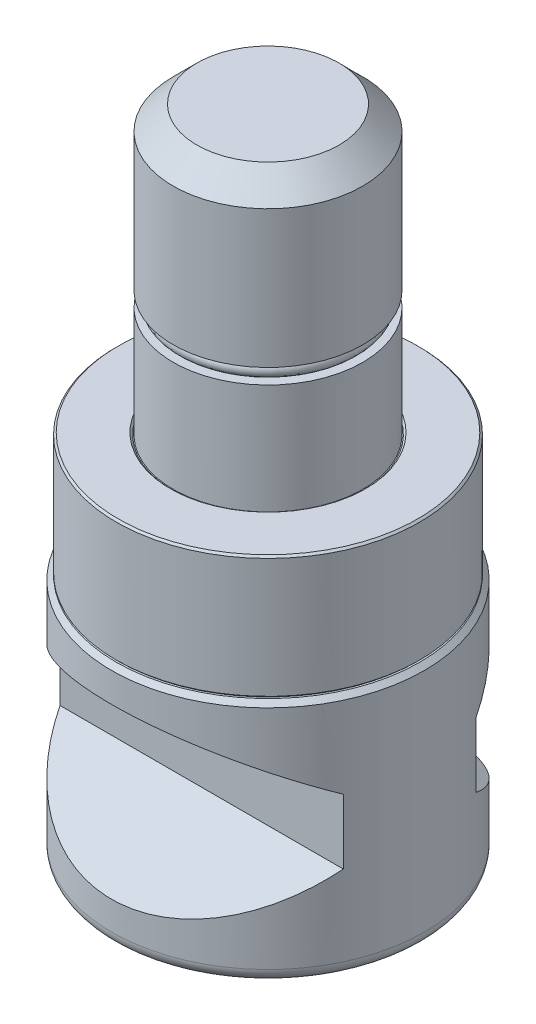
ISO-10303-21;
HEADER;
FILE_DESCRIPTION(('STEP AP214'),'2;1');
FILE_NAME('part.step','',(''),(''),'','','');
FILE_SCHEMA(('AUTOMOTIVE_DESIGN { 1 0 10303 214 1 1 1 1 }'));
ENDSEC;
DATA;
#1=APPLICATION_CONTEXT('core data for automotive mechanical design processes');
#2=APPLICATION_PROTOCOL_DEFINITION('international standard','automotive_design',2000,#1);
#3=PRODUCT_CONTEXT('',#1,'mechanical');
#4=PRODUCT('Part','Part','',(#3));
#5=PRODUCT_RELATED_PRODUCT_CATEGORY('part','',(#4));
#6=PRODUCT_DEFINITION_FORMATION('','',#4);
#7=PRODUCT_DEFINITION_CONTEXT('part definition',#1,'design');
#8=PRODUCT_DEFINITION('design','',#6,#7);
#9=PRODUCT_DEFINITION_SHAPE('','',#8);
#10=(LENGTH_UNIT() NAMED_UNIT(*) SI_UNIT(.MILLI.,.METRE.));
#11=(NAMED_UNIT(*) PLANE_ANGLE_UNIT() SI_UNIT($,.RADIAN.));
#12=(NAMED_UNIT(*) SI_UNIT($,.STERADIAN.) SOLID_ANGLE_UNIT());
#13=UNCERTAINTY_MEASURE_WITH_UNIT(LENGTH_MEASURE(1.E-05),#10,'distance_accuracy_value','');
#14=(GEOMETRIC_REPRESENTATION_CONTEXT(3) GLOBAL_UNCERTAINTY_ASSIGNED_CONTEXT((#13)) GLOBAL_UNIT_ASSIGNED_CONTEXT((#10,
#11,#12)) REPRESENTATION_CONTEXT('',''));
#15=CARTESIAN_POINT('',(0.,0.,0.));
#16=DIRECTION('',(0.,0.,1.));
#17=DIRECTION('',(1.,0.,0.));
#18=AXIS2_PLACEMENT_3D('',#15,#16,#17);
#19=CARTESIAN_POINT('',(0.,13.,0.));
#20=DIRECTION('',(0.,-1.,0.));
#21=DIRECTION('',(-0.99001051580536,0.,-0.140993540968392));
#22=AXIS2_PLACEMENT_3D('',#19,#20,#21);
#23=CYLINDRICAL_SURFACE('',#22,16.);
#24=CARTESIAN_POINT('',(0.,0.199999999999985,0.));
#25=DIRECTION('',(0.,-1.,0.));
#26=DIRECTION('',(-0.99001051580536,0.,-0.140993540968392));
#27=AXIS2_PLACEMENT_3D('',#24,#25,#26);
#28=CIRCLE('',#27,16.);
#29=CARTESIAN_POINT('',(-15.8401682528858,0.199999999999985,-2.25589665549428));
#30=VERTEX_POINT('',#29);
#31=EDGE_CURVE('E287',#30,#30,#28,.F.);
#32=ORIENTED_EDGE('',*,*,#31,.T.);
#33=EDGE_LOOP('',(#32));
#34=FACE_BOUND('',#33,.T.);
#35=CARTESIAN_POINT('',(0.,12.8,0.));
#36=DIRECTION('',(0.,1.,0.));
#37=DIRECTION('',(0.99001051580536,0.,0.140993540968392));
#38=AXIS2_PLACEMENT_3D('',#35,#36,#37);
#39=CIRCLE('',#38,16.);
#40=CARTESIAN_POINT('',(15.8401682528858,12.8,2.25589665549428));
#41=VERTEX_POINT('',#40);
#42=EDGE_CURVE('E546',#41,#41,#39,.F.);
#43=ORIENTED_EDGE('',*,*,#42,.T.);
#44=EDGE_LOOP('',(#43));
#45=FACE_BOUND('',#44,.T.);
#46=ADVANCED_FACE('F16',(#34,#45),#23,.T.);
#47=CARTESIAN_POINT('',(1.42403476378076,13.,-9.99910620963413));
#48=DIRECTION('',(0.,1.,0.));
#49=DIRECTION('',(0.99001051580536,0.,0.140993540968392));
#50=AXIS2_PLACEMENT_3D('',#47,#48,#49);
#51=PLANE('',#50);
#52=CARTESIAN_POINT('',(0.,13.,0.));
#53=DIRECTION('',(0.,1.,0.));
#54=DIRECTION('',(0.99001051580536,0.,0.140993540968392));
#55=AXIS2_PLACEMENT_3D('',#52,#53,#54);
#56=CIRCLE('',#55,15.8);
#57=CARTESIAN_POINT('',(15.6421661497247,13.,2.2276979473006));
#58=VERTEX_POINT('',#57);
#59=EDGE_CURVE('E549',#58,#58,#56,.T.);
#60=ORIENTED_EDGE('',*,*,#59,.T.);
#61=EDGE_LOOP('',(#60));
#62=FACE_BOUND('',#61,.T.);
#63=CARTESIAN_POINT('',(0.,13.,0.));
#64=DIRECTION('',(0.,1.,0.));
#65=DIRECTION('',(0.99001051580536,0.,0.140993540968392));
#66=AXIS2_PLACEMENT_3D('',#63,#64,#65);
#67=CIRCLE('',#66,10.3);
#68=CARTESIAN_POINT('',(10.1971083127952,13.,1.45223347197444));
#69=VERTEX_POINT('',#68);
#70=EDGE_CURVE('E541',#69,#69,#67,.F.);
#71=ORIENTED_EDGE('',*,*,#70,.T.);
#72=EDGE_LOOP('',(#71));
#73=FACE_BOUND('',#72,.T.);
#74=ADVANCED_FACE('F257',(#62,#73),#51,.T.);
#75=CARTESIAN_POINT('',(0.,13.,0.));
#76=DIRECTION('',(0.,1.,0.));
#77=DIRECTION('',(0.99001051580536,0.,0.140993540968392));
#78=AXIS2_PLACEMENT_3D('',#75,#76,#77);
#79=CONICAL_SURFACE('',#78,10.3,0.785398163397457);
#80=CARTESIAN_POINT('',(0.,12.8,0.));
#81=DIRECTION('',(0.,1.,0.));
#82=DIRECTION('',(0.99001051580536,0.,0.140993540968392));
#83=AXIS2_PLACEMENT_3D('',#80,#81,#82);
#84=CIRCLE('',#83,10.1);
#85=CARTESIAN_POINT('',(9.99910620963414,12.8,1.42403476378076));
#86=VERTEX_POINT('',#85);
#87=EDGE_CURVE('E544',#86,#86,#84,.T.);
#88=ORIENTED_EDGE('',*,*,#87,.F.);
#89=EDGE_LOOP('',(#88));
#90=FACE_BOUND('',#89,.T.);
#91=ORIENTED_EDGE('',*,*,#70,.F.);
#92=EDGE_LOOP('',(#91));
#93=FACE_BOUND('',#92,.T.);
#94=ADVANCED_FACE('F264',(#90,#93),#79,.F.);
#95=CARTESIAN_POINT('',(0.,12.8,0.));
#96=DIRECTION('',(0.,-1.,0.));
#97=DIRECTION('',(-0.99001051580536,0.,-0.140993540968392));
#98=AXIS2_PLACEMENT_3D('',#95,#96,#97);
#99=CONICAL_SURFACE('',#98,16.,0.785398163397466);
#100=ORIENTED_EDGE('',*,*,#59,.F.);
#101=EDGE_LOOP('',(#100));
#102=FACE_BOUND('',#101,.T.);
#103=ORIENTED_EDGE('',*,*,#42,.F.);
#104=EDGE_LOOP('',(#103));
#105=FACE_BOUND('',#104,.T.);
#106=ADVANCED_FACE('F273',(#102,#105),#99,.T.);
#107=CARTESIAN_POINT('',(0.,0.,0.));
#108=DIRECTION('',(0.,1.,0.));
#109=DIRECTION('',(0.99001051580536,0.,0.140993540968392));
#110=AXIS2_PLACEMENT_3D('',#107,#108,#109);
#111=CONICAL_SURFACE('',#110,15.8,0.785398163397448);
#112=ORIENTED_EDGE('',*,*,#31,.F.);
#113=EDGE_LOOP('',(#112));
#114=FACE_BOUND('',#113,.T.);
#115=CARTESIAN_POINT('',(0.,0.,0.));
#116=DIRECTION('',(0.,1.,0.));
#117=DIRECTION('',(0.,0.,1.));
#118=AXIS2_PLACEMENT_3D('',#115,#116,#117);
#119=CIRCLE('',#118,15.8);
#120=CARTESIAN_POINT('',(0.,0.,15.8));
#121=VERTEX_POINT('',#120);
#122=EDGE_CURVE('E10',#121,#121,#119,.T.);
#123=ORIENTED_EDGE('',*,*,#122,.T.);
#124=EDGE_LOOP('',(#123));
#125=FACE_BOUND('',#124,.T.);
#126=ADVANCED_FACE('F276',(#114,#125),#111,.T.);
#127=CARTESIAN_POINT('',(0.,-20.4,0.));
#128=DIRECTION('',(0.,-1.,0.));
#129=DIRECTION('',(-1.,0.,0.));
#130=AXIS2_PLACEMENT_3D('',#127,#128,#129);
#131=PLANE('',#130);
#132=DIRECTION('',(-0.866025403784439,0.,-0.5));
#133=VECTOR('',#132,1.);
#134=CARTESIAN_POINT('',(0.,-20.4,4.61880215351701));
#135=LINE('',#134,#133);
#136=CARTESIAN_POINT('',(0.,-20.4,4.61880215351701));
#137=VERTEX_POINT('',#136);
#138=CARTESIAN_POINT('',(-4.,-20.4,2.30940107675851));
#139=VERTEX_POINT('',#138);
#140=EDGE_CURVE('E122',#137,#139,#135,.T.);
#141=ORIENTED_EDGE('',*,*,#140,.T.);
#142=DIRECTION('',(0.,0.,-1.));
#143=VECTOR('',#142,1.);
#144=CARTESIAN_POINT('',(-4.,-20.4,2.30940107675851));
#145=LINE('',#144,#143);
#146=CARTESIAN_POINT('',(-4.,-20.4,-2.30940107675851));
#147=VERTEX_POINT('',#146);
#148=EDGE_CURVE('E118',#139,#147,#145,.T.);
#149=ORIENTED_EDGE('',*,*,#148,.T.);
#150=DIRECTION('',(0.866025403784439,0.,-0.5));
#151=VECTOR('',#150,1.);
#152=CARTESIAN_POINT('',(-4.,-20.4,-2.30940107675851));
#153=LINE('',#152,#151);
#154=CARTESIAN_POINT('',(0.,-20.4,-4.61880215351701));
#155=VERTEX_POINT('',#154);
#156=EDGE_CURVE('E111',#147,#155,#153,.T.);
#157=ORIENTED_EDGE('',*,*,#156,.T.);
#158=DIRECTION('',(0.866025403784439,0.,0.5));
#159=VECTOR('',#158,1.);
#160=CARTESIAN_POINT('',(0.,-20.4,-4.61880215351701));
#161=LINE('',#160,#159);
#162=CARTESIAN_POINT('',(4.,-20.4,-2.3094010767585));
#163=VERTEX_POINT('',#162);
#164=EDGE_CURVE('E115',#155,#163,#161,.T.);
#165=ORIENTED_EDGE('',*,*,#164,.T.);
#166=DIRECTION('',(0.,0.,1.));
#167=VECTOR('',#166,1.);
#168=CARTESIAN_POINT('',(4.,-20.4,-2.3094010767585));
#169=LINE('',#168,#167);
#170=CARTESIAN_POINT('',(4.,-20.4,2.30940107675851));
#171=VERTEX_POINT('',#170);
#172=EDGE_CURVE('E574',#163,#171,#169,.T.);
#173=ORIENTED_EDGE('',*,*,#172,.T.);
#174=DIRECTION('',(-0.866025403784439,0.,0.5));
#175=VECTOR('',#174,1.);
#176=CARTESIAN_POINT('',(4.,-20.4,2.30940107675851));
#177=LINE('',#176,#175);
#178=EDGE_CURVE('E572',#171,#137,#177,.T.);
#179=ORIENTED_EDGE('',*,*,#178,.T.);
#180=EDGE_LOOP('',(#141,#149,#157,#165,#173,#179));
#181=FACE_BOUND('',#180,.T.);
#182=ADVANCED_FACE('F198',(#181),#131,.T.);
#183=CARTESIAN_POINT('',(0.,-20.4,-4.61880215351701));
#184=DIRECTION('',(0.5,0.,-0.866025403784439));
#185=DIRECTION('',(-0.866025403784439,0.,-0.5));
#186=AXIS2_PLACEMENT_3D('',#183,#184,#185);
#187=PLANE('',#186);
#188=CARTESIAN_POINT('',(4.0002,-25.6799819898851,-2.30928560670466));
#189=CARTESIAN_POINT('',(3.82442084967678,-25.6213676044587,-2.4107717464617));
#190=CARTESIAN_POINT('',(3.64712438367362,-25.5680600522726,-2.51313390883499));
#191=CARTESIAN_POINT('',(3.2894614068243,-25.4750114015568,-2.71963072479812));
#192=CARTESIAN_POINT('',(3.10908854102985,-25.4353032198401,-2.82376904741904));
#193=CARTESIAN_POINT('',(2.75057818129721,-25.3734919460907,-3.03075510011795));
#194=CARTESIAN_POINT('',(2.57249584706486,-25.3509774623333,-3.13357098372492));
#195=CARTESIAN_POINT('',(2.21549328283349,-25.324100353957,-3.33968651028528));
#196=CARTESIAN_POINT('',(2.03657435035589,-25.3197154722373,-3.44298540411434));
#197=CARTESIAN_POINT('',(1.70225715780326,-25.3288398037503,-3.63600352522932));
#198=CARTESIAN_POINT('',(1.54680884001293,-25.3401086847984,-3.72575165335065));
#199=CARTESIAN_POINT('',(1.23692494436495,-25.3758237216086,-3.90466320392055));
#200=CARTESIAN_POINT('',(1.08249043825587,-25.4002820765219,-3.99382600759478));
#201=CARTESIAN_POINT('',(0.771967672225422,-25.4614257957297,-4.17310641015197));
#202=CARTESIAN_POINT('',(0.615918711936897,-25.4983703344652,-4.26320131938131));
#203=CARTESIAN_POINT('',(0.306148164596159,-25.5822198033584,-4.44204742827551));
#204=CARTESIAN_POINT('',(0.152422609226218,-25.6291050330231,-4.53080091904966));
#205=CARTESIAN_POINT('',(-0.000200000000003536,-25.6799819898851,-4.61891762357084));
#206=B_SPLINE_CURVE_WITH_KNOTS('',3,(#188,#189,#190,#191,#192,#193,#194,#195,#196,#197,#198,
#199,#200,#201,#202,#203,#204,#205),.UNSPECIFIED.,.F.,.F.,(4,2,2,2,2,2,2,2,4),(0.,
0.634047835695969,1.26961969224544,1.88946157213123,2.50854226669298,3.04757825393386,
3.58711366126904,4.13861653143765,4.68903648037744),.UNSPECIFIED.);
#207=CARTESIAN_POINT('',(4.,-25.6799153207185,-2.3094010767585));
#208=VERTEX_POINT('',#207);
#209=CARTESIAN_POINT('',(0.,-25.6799153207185,-4.61880215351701));
#210=VERTEX_POINT('',#209);
#211=EDGE_CURVE('E91',#208,#210,#206,.T.);
#212=ORIENTED_EDGE('',*,*,#211,.F.);
#213=DIRECTION('',(0.,-1.,0.));
#214=VECTOR('',#213,1.);
#215=CARTESIAN_POINT('',(4.,-20.4,-2.3094010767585));
#216=LINE('',#215,#214);
#217=EDGE_CURVE('E117',#163,#208,#216,.T.);
#218=ORIENTED_EDGE('',*,*,#217,.F.);
#219=ORIENTED_EDGE('',*,*,#164,.F.);
#220=DIRECTION('',(0.,-1.,0.));
#221=VECTOR('',#220,1.);
#222=CARTESIAN_POINT('',(0.,-20.4,-4.61880215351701));
#223=LINE('',#222,#221);
#224=EDGE_CURVE('E108',#155,#210,#223,.T.);
#225=ORIENTED_EDGE('',*,*,#224,.T.);
#226=EDGE_LOOP('',(#212,#218,#219,#225));
#227=FACE_BOUND('',#226,.T.);
#228=ADVANCED_FACE('F114',(#227),#187,.F.);
#229=CARTESIAN_POINT('',(4.,-20.4,-2.3094010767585));
#230=DIRECTION('',(1.,0.,0.));
#231=DIRECTION('',(0.,0.,-1.));
#232=AXIS2_PLACEMENT_3D('',#229,#230,#231);
#233=PLANE('',#232);
#234=CARTESIAN_POINT('',(4.,-28.051779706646,7.75631262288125));
#235=CARTESIAN_POINT('',(4.,-27.9588271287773,7.57514094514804));
#236=CARTESIAN_POINT('',(4.,-27.8663960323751,7.39369931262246));
#237=CARTESIAN_POINT('',(4.,-27.6828377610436,7.03015351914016));
#238=CARTESIAN_POINT('',(4.,-27.5917106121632,6.84804934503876));
#239=CARTESIAN_POINT('',(4.,-27.4108738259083,6.48275784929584));
#240=CARTESIAN_POINT('',(4.,-27.3211668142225,6.29956922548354));
#241=CARTESIAN_POINT('',(4.,-27.1436851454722,5.93225352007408));
#242=CARTESIAN_POINT('',(4.,-27.0559105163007,5.74812642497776));
#243=CARTESIAN_POINT('',(4.,-26.8782736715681,5.36918294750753));
#244=CARTESIAN_POINT('',(4.,-26.7885386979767,5.17430674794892));
#245=CARTESIAN_POINT('',(4.,-26.6124381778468,4.78304464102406));
#246=CARTESIAN_POINT('',(4.,-26.5260724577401,4.58665881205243));
#247=CARTESIAN_POINT('',(4.,-26.3577259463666,4.19216428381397));
#248=CARTESIAN_POINT('',(4.,-26.2757422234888,3.99405684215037));
#249=CARTESIAN_POINT('',(4.,-26.1173873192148,3.59554249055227));
#250=CARTESIAN_POINT('',(4.,-26.0410174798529,3.39513504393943));
#251=CARTESIAN_POINT('',(4.,-25.8833087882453,2.9573369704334));
#252=CARTESIAN_POINT('',(4.,-25.803331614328,2.71944997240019));
#253=CARTESIAN_POINT('',(4.,-25.6573348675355,2.23943941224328));
#254=CARTESIAN_POINT('',(4.,-25.5913080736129,1.99731811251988));
#255=CARTESIAN_POINT('',(4.,-25.5069180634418,1.6331545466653));
#256=CARTESIAN_POINT('',(4.,-25.4814067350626,1.51276218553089));
#257=CARTESIAN_POINT('',(4.,-25.4355332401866,1.27099219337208));
#258=CARTESIAN_POINT('',(4.,-25.4151709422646,1.14961458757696));
#259=CARTESIAN_POINT('',(4.,-25.3801799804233,0.906083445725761));
#260=CARTESIAN_POINT('',(4.,-25.3655487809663,0.783930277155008));
#261=CARTESIAN_POINT('',(4.,-25.342481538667,0.539041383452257));
#262=CARTESIAN_POINT('',(4.,-25.334045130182,0.416305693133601));
#263=CARTESIAN_POINT('',(4.,-25.3235999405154,0.169007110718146));
#264=CARTESIAN_POINT('',(4.,-25.3216735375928,0.0444406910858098));
#265=CARTESIAN_POINT('',(4.,-25.3245515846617,-0.204613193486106));
#266=CARTESIAN_POINT('',(4.,-25.3293560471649,-0.329100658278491));
#267=CARTESIAN_POINT('',(4.,-25.3455188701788,-0.577675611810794));
#268=CARTESIAN_POINT('',(4.,-25.3568787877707,-0.701762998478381));
#269=CARTESIAN_POINT('',(4.,-25.3857527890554,-0.949226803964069));
#270=CARTESIAN_POINT('',(4.,-25.4032678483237,-1.07260310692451));
#271=CARTESIAN_POINT('',(4.,-25.4650360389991,-1.44616252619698));
#272=CARTESIAN_POINT('',(4.,-25.5181610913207,-1.69489636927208));
#273=CARTESIAN_POINT('',(4.,-25.6423652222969,-2.18772666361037));
#274=CARTESIAN_POINT('',(4.,-25.7134490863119,-2.43182186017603));
#275=CARTESIAN_POINT('',(4.,-25.8639633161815,-2.90091972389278));
#276=CARTESIAN_POINT('',(4.,-25.9426157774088,-3.12617606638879));
#277=CARTESIAN_POINT('',(4.,-26.1084502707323,-3.57354672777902));
#278=CARTESIAN_POINT('',(4.,-26.1956341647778,-3.79566034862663));
#279=CARTESIAN_POINT('',(4.,-26.3763941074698,-4.23751628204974));
#280=CARTESIAN_POINT('',(4.,-26.4699765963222,-4.45725593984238));
#281=CARTESIAN_POINT('',(4.,-26.6618648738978,-4.89462873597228));
#282=CARTESIAN_POINT('',(4.,-26.7601702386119,-5.11226206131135));
#283=CARTESIAN_POINT('',(4.,-26.9548904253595,-5.53396134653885));
#284=CARTESIAN_POINT('',(4.,-27.0511129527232,-5.73811644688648));
#285=CARTESIAN_POINT('',(4.,-27.246089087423,-6.14521937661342));
#286=CARTESIAN_POINT('',(4.,-27.3448427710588,-6.34816716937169));
#287=CARTESIAN_POINT('',(4.,-27.5440508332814,-6.75245129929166));
#288=CARTESIAN_POINT('',(4.,-27.6444990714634,-6.95379066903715));
#289=CARTESIAN_POINT('',(4.,-27.847014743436,-7.35563323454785));
#290=CARTESIAN_POINT('',(4.,-27.9490820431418,-7.5561364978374));
#291=CARTESIAN_POINT('',(4.,-28.051779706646,-7.75631262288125));
#292=B_SPLINE_CURVE_WITH_KNOTS('',3,(#234,#235,#236,#237,#238,#239,#240,#241,#242,#243,#244,
#245,#246,#247,#248,#249,#250,#251,#252,#253,#254,#255,#256,#257,#258,#259,#260,#261,#262,#263,
#264,#265,#266,#267,#268,#269,#270,#271,#272,#273,#274,#275,#276,#277,#278,#279,#280,#281,#282,
#283,#284,#285,#286,#287,#288,#289,#290,#291),.UNSPECIFIED.,.F.,.F.,(4,2,2,2,2,2,2,2,2,2,2,2,2,
2,2,2,2,2,2,2,2,2,2,2,2,2,2,2,4),(0.,0.610878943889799,1.22177007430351,1.83368291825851,
2.44560458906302,3.08921144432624,3.73278510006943,4.37592266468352,5.0192134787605,
5.77184296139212,6.52408190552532,6.8931867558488,7.26228218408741,7.63121413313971,
8.00012430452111,8.37368556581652,8.74724752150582,9.12089824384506,9.49460821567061,
10.2566439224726,11.0188828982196,11.7344344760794,12.4501425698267,13.1665819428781,
13.8829571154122,14.5600200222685,15.2371033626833,15.9121114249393,16.5870638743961),.UNSPECIFIED.);
#293=CARTESIAN_POINT('',(4.,-25.6799153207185,2.30940107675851));
#294=VERTEX_POINT('',#293);
#295=EDGE_CURVE('E31',#294,#208,#292,.T.);
#296=ORIENTED_EDGE('',*,*,#295,.F.);
#297=DIRECTION('',(0.,-1.,0.));
#298=VECTOR('',#297,1.);
#299=CARTESIAN_POINT('',(4.,-20.4,2.30940107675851));
#300=LINE('',#299,#298);
#301=EDGE_CURVE('E120',#171,#294,#300,.T.);
#302=ORIENTED_EDGE('',*,*,#301,.F.);
#303=ORIENTED_EDGE('',*,*,#172,.F.);
#304=ORIENTED_EDGE('',*,*,#217,.T.);
#305=EDGE_LOOP('',(#296,#302,#303,#304));
#306=FACE_BOUND('',#305,.T.);
#307=ADVANCED_FACE('F246',(#306),#233,.F.);
#308=CARTESIAN_POINT('',(4.,-20.4,2.30940107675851));
#309=DIRECTION('',(0.5,0.,0.866025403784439));
#310=DIRECTION('',(0.866025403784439,0.,-0.5));
#311=AXIS2_PLACEMENT_3D('',#308,#309,#310);
#312=PLANE('',#311);
#313=CARTESIAN_POINT('',(-0.000199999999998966,-25.6799819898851,4.61891762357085));
#314=CARTESIAN_POINT('',(0.175579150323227,-25.6213676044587,4.51743148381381));
#315=CARTESIAN_POINT('',(0.352875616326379,-25.5680600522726,4.41506932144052));
#316=CARTESIAN_POINT('',(0.710538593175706,-25.4750114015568,4.2085725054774));
#317=CARTESIAN_POINT('',(0.890911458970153,-25.4353032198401,4.10443418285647));
#318=CARTESIAN_POINT('',(1.24942181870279,-25.3734919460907,3.89744813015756));
#319=CARTESIAN_POINT('',(1.42750415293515,-25.3509774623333,3.79463224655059));
#320=CARTESIAN_POINT('',(1.78450671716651,-25.324100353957,3.58851671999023));
#321=CARTESIAN_POINT('',(1.9634256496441,-25.3197154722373,3.48521782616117));
#322=CARTESIAN_POINT('',(2.29774284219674,-25.3288398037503,3.29219970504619));
#323=CARTESIAN_POINT('',(2.45319115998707,-25.3401086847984,3.20245157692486));
#324=CARTESIAN_POINT('',(2.76307505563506,-25.3758237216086,3.02354002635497));
#325=CARTESIAN_POINT('',(2.91750956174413,-25.4002820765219,2.93437722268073));
#326=CARTESIAN_POINT('',(3.22803232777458,-25.4614257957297,2.75509682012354));
#327=CARTESIAN_POINT('',(3.3840812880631,-25.4983703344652,2.6650019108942));
#328=CARTESIAN_POINT('',(3.69385183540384,-25.5822198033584,2.48615580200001));
#329=CARTESIAN_POINT('',(3.84757739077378,-25.6291050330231,2.39740231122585));
#330=CARTESIAN_POINT('',(4.0002,-25.6799819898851,2.30928560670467));
#331=B_SPLINE_CURVE_WITH_KNOTS('',3,(#313,#314,#315,#316,#317,#318,#319,#320,#321,#322,#323,
#324,#325,#326,#327,#328,#329,#330),.UNSPECIFIED.,.F.,.F.,(4,2,2,2,2,2,2,2,4),(0.,
0.634047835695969,1.26961969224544,1.88946157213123,2.50854226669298,3.04757825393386,
3.58711366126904,4.13861653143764,4.68903648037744),.UNSPECIFIED.);
#332=CARTESIAN_POINT('',(0.,-25.6799153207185,4.61880215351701));
#333=VERTEX_POINT('',#332);
#334=EDGE_CURVE('E212',#333,#294,#331,.T.);
#335=ORIENTED_EDGE('',*,*,#334,.F.);
#336=DIRECTION('',(0.,-1.,0.));
#337=VECTOR('',#336,1.);
#338=CARTESIAN_POINT('',(0.,-20.4,4.61880215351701));
#339=LINE('',#338,#337);
#340=EDGE_CURVE('E563',#137,#333,#339,.T.);
#341=ORIENTED_EDGE('',*,*,#340,.F.);
#342=ORIENTED_EDGE('',*,*,#178,.F.);
#343=ORIENTED_EDGE('',*,*,#301,.T.);
#344=EDGE_LOOP('',(#335,#341,#342,#343));
#345=FACE_BOUND('',#344,.T.);
#346=ADVANCED_FACE('F242',(#345),#312,.F.);
#347=CARTESIAN_POINT('',(0.,-20.4,4.61880215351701));
#348=DIRECTION('',(-0.5,0.,0.866025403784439));
#349=DIRECTION('',(0.866025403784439,0.,0.5));
#350=AXIS2_PLACEMENT_3D('',#347,#348,#349);
#351=PLANE('',#350);
#352=CARTESIAN_POINT('',(-4.0002,-25.6799819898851,2.30928560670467));
#353=CARTESIAN_POINT('',(-3.82442084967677,-25.6213676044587,2.41077174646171));
#354=CARTESIAN_POINT('',(-3.64712438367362,-25.5680600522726,2.513133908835));
#355=CARTESIAN_POINT('',(-3.28946140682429,-25.4750114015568,2.71963072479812));
#356=CARTESIAN_POINT('',(-3.10908854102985,-25.4353032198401,2.82376904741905));
#357=CARTESIAN_POINT('',(-2.75057818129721,-25.3734919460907,3.03075510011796));
#358=CARTESIAN_POINT('',(-2.57249584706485,-25.3509774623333,3.13357098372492));
#359=CARTESIAN_POINT('',(-2.21549328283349,-25.324100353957,3.33968651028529));
#360=CARTESIAN_POINT('',(-2.03657435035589,-25.3197154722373,3.44298540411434));
#361=CARTESIAN_POINT('',(-1.70225715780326,-25.3288398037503,3.63600352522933));
#362=CARTESIAN_POINT('',(-1.54680884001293,-25.3401086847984,3.72575165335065));
#363=CARTESIAN_POINT('',(-1.23692494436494,-25.3758237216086,3.90466320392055));
#364=CARTESIAN_POINT('',(-1.08249043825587,-25.4002820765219,3.99382600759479));
#365=CARTESIAN_POINT('',(-0.771967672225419,-25.4614257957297,4.17310641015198));
#366=CARTESIAN_POINT('',(-0.615918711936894,-25.4983703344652,4.26320131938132));
#367=CARTESIAN_POINT('',(-0.306148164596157,-25.5822198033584,4.44204742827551));
#368=CARTESIAN_POINT('',(-0.152422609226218,-25.6291050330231,4.53080091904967));
#369=CARTESIAN_POINT('',(0.000200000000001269,-25.6799819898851,4.61891762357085));
#370=B_SPLINE_CURVE_WITH_KNOTS('',3,(#352,#353,#354,#355,#356,#357,#358,#359,#360,#361,#362,
#363,#364,#365,#366,#367,#368,#369),.UNSPECIFIED.,.F.,.F.,(4,2,2,2,2,2,2,2,4),(0.,
0.634047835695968,1.26961969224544,1.88946157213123,2.50854226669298,3.04757825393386,
3.58711366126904,4.13861653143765,4.68903648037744),.UNSPECIFIED.);
#371=CARTESIAN_POINT('',(-4.,-25.6799153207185,2.30940107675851));
#372=VERTEX_POINT('',#371);
#373=EDGE_CURVE('E219',#372,#333,#370,.T.);
#374=ORIENTED_EDGE('',*,*,#373,.F.);
#375=DIRECTION('',(0.,-1.,0.));
#376=VECTOR('',#375,1.);
#377=CARTESIAN_POINT('',(-4.,-20.4,2.30940107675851));
#378=LINE('',#377,#376);
#379=EDGE_CURVE('E566',#139,#372,#378,.T.);
#380=ORIENTED_EDGE('',*,*,#379,.F.);
#381=ORIENTED_EDGE('',*,*,#140,.F.);
#382=ORIENTED_EDGE('',*,*,#340,.T.);
#383=EDGE_LOOP('',(#374,#380,#381,#382));
#384=FACE_BOUND('',#383,.T.);
#385=ADVANCED_FACE('F238',(#384),#351,.F.);
#386=CARTESIAN_POINT('',(-4.,-20.4,2.30940107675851));
#387=DIRECTION('',(-1.,0.,0.));
#388=DIRECTION('',(0.,0.,1.));
#389=AXIS2_PLACEMENT_3D('',#386,#387,#388);
#390=PLANE('',#389);
#391=CARTESIAN_POINT('',(-4.,-28.051779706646,-7.75631262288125));
#392=CARTESIAN_POINT('',(-4.,-27.9588271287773,-7.57514094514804));
#393=CARTESIAN_POINT('',(-4.,-27.8663960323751,-7.39369931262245));
#394=CARTESIAN_POINT('',(-4.,-27.6828377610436,-7.03015351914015));
#395=CARTESIAN_POINT('',(-4.,-27.5917106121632,-6.84804934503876));
#396=CARTESIAN_POINT('',(-4.,-27.4108738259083,-6.48275784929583));
#397=CARTESIAN_POINT('',(-4.,-27.3211668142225,-6.29956922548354));
#398=CARTESIAN_POINT('',(-4.,-27.1436851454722,-5.93225352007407));
#399=CARTESIAN_POINT('',(-4.,-27.0559105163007,-5.74812642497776));
#400=CARTESIAN_POINT('',(-4.,-26.8782736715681,-5.36918294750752));
#401=CARTESIAN_POINT('',(-4.,-26.7885386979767,-5.17430674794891));
#402=CARTESIAN_POINT('',(-4.,-26.6124381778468,-4.78304464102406));
#403=CARTESIAN_POINT('',(-4.,-26.5260724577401,-4.58665881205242));
#404=CARTESIAN_POINT('',(-4.,-26.3577259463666,-4.19216428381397));
#405=CARTESIAN_POINT('',(-4.,-26.2757422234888,-3.99405684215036));
#406=CARTESIAN_POINT('',(-4.,-26.1173873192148,-3.59554249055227));
#407=CARTESIAN_POINT('',(-4.,-26.0410174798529,-3.39513504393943));
#408=CARTESIAN_POINT('',(-4.,-25.8833087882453,-2.9573369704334));
#409=CARTESIAN_POINT('',(-4.,-25.803331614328,-2.71944997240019));
#410=CARTESIAN_POINT('',(-4.,-25.6573348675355,-2.23943941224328));
#411=CARTESIAN_POINT('',(-4.,-25.5913080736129,-1.99731811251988));
#412=CARTESIAN_POINT('',(-4.,-25.5069180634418,-1.6331545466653));
#413=CARTESIAN_POINT('',(-4.,-25.4814067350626,-1.51276218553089));
#414=CARTESIAN_POINT('',(-4.,-25.4355332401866,-1.27099219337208));
#415=CARTESIAN_POINT('',(-4.,-25.4151709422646,-1.14961458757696));
#416=CARTESIAN_POINT('',(-4.,-25.3801799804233,-0.906083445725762));
#417=CARTESIAN_POINT('',(-4.,-25.3655487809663,-0.78393027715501));
#418=CARTESIAN_POINT('',(-4.,-25.342481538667,-0.539041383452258));
#419=CARTESIAN_POINT('',(-4.,-25.334045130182,-0.416305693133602));
#420=CARTESIAN_POINT('',(-4.,-25.3235999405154,-0.169007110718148));
#421=CARTESIAN_POINT('',(-4.,-25.3216735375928,-0.0444406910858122));
#422=CARTESIAN_POINT('',(-4.,-25.3245515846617,0.204613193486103));
#423=CARTESIAN_POINT('',(-4.,-25.3293560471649,0.329100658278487));
#424=CARTESIAN_POINT('',(-4.,-25.3455188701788,0.57767561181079));
#425=CARTESIAN_POINT('',(-4.,-25.3568787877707,0.701762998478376));
#426=CARTESIAN_POINT('',(-4.,-25.3857527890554,0.949226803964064));
#427=CARTESIAN_POINT('',(-4.,-25.4032678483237,1.07260310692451));
#428=CARTESIAN_POINT('',(-4.,-25.4650360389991,1.44616252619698));
#429=CARTESIAN_POINT('',(-4.,-25.5181610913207,1.69489636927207));
#430=CARTESIAN_POINT('',(-4.,-25.6423652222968,2.18772666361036));
#431=CARTESIAN_POINT('',(-4.,-25.7134490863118,2.43182186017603));
#432=CARTESIAN_POINT('',(-4.,-25.8639633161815,2.90091972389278));
#433=CARTESIAN_POINT('',(-4.,-25.9426157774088,3.12617606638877));
#434=CARTESIAN_POINT('',(-4.,-26.1084502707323,3.573546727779));
#435=CARTESIAN_POINT('',(-4.,-26.1956341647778,3.79566034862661));
#436=CARTESIAN_POINT('',(-4.,-26.3763941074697,4.23751628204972));
#437=CARTESIAN_POINT('',(-4.,-26.4699765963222,4.45725593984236));
#438=CARTESIAN_POINT('',(-4.,-26.6618648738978,4.89462873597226));
#439=CARTESIAN_POINT('',(-4.,-26.7601702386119,5.11226206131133));
#440=CARTESIAN_POINT('',(-4.,-26.9548904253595,5.53396134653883));
#441=CARTESIAN_POINT('',(-4.,-27.0511129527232,5.73811644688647));
#442=CARTESIAN_POINT('',(-4.,-27.246089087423,6.14521937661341));
#443=CARTESIAN_POINT('',(-4.,-27.3448427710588,6.34816716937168));
#444=CARTESIAN_POINT('',(-4.,-27.5440508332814,6.75245129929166));
#445=CARTESIAN_POINT('',(-4.,-27.6444990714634,6.95379066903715));
#446=CARTESIAN_POINT('',(-4.,-27.847014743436,7.35563323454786));
#447=CARTESIAN_POINT('',(-4.,-27.9490820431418,7.5561364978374));
#448=CARTESIAN_POINT('',(-4.,-28.051779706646,7.75631262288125));
#449=B_SPLINE_CURVE_WITH_KNOTS('',3,(#391,#392,#393,#394,#395,#396,#397,#398,#399,#400,#401,
#402,#403,#404,#405,#406,#407,#408,#409,#410,#411,#412,#413,#414,#415,#416,#417,#418,#419,#420,
#421,#422,#423,#424,#425,#426,#427,#428,#429,#430,#431,#432,#433,#434,#435,#436,#437,#438,#439,
#440,#441,#442,#443,#444,#445,#446,#447,#448),.UNSPECIFIED.,.F.,.F.,(4,2,2,2,2,2,2,2,2,2,2,2,2,
2,2,2,2,2,2,2,2,2,2,2,2,2,2,2,4),(0.,0.610878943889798,1.22177007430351,1.83368291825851,
2.44560458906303,3.08921144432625,3.73278510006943,4.37592266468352,5.0192134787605,
5.77184296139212,6.52408190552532,6.8931867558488,7.26228218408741,7.63121413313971,
8.00012430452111,8.37368556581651,8.74724752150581,9.12089824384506,9.4946082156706,
10.2566439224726,11.0188828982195,11.7344344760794,12.4501425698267,13.166581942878,
13.8829571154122,14.5600200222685,15.2371033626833,15.9121114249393,16.5870638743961),.UNSPECIFIED.);
#450=CARTESIAN_POINT('',(-4.,-25.6799153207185,-2.30940107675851));
#451=VERTEX_POINT('',#450);
#452=EDGE_CURVE('E112',#451,#372,#449,.T.);
#453=ORIENTED_EDGE('',*,*,#452,.F.);
#454=DIRECTION('',(0.,-1.,0.));
#455=VECTOR('',#454,1.);
#456=CARTESIAN_POINT('',(-4.,-20.4,-2.30940107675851));
#457=LINE('',#456,#455);
#458=EDGE_CURVE('E110',#147,#451,#457,.T.);
#459=ORIENTED_EDGE('',*,*,#458,.F.);
#460=ORIENTED_EDGE('',*,*,#148,.F.);
#461=ORIENTED_EDGE('',*,*,#379,.T.);
#462=EDGE_LOOP('',(#453,#459,#460,#461));
#463=FACE_BOUND('',#462,.T.);
#464=ADVANCED_FACE('F235',(#463),#390,.F.);
#465=CARTESIAN_POINT('',(-4.,-20.4,-2.30940107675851));
#466=DIRECTION('',(-0.5,0.,-0.866025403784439));
#467=DIRECTION('',(-0.866025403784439,0.,0.5));
#468=AXIS2_PLACEMENT_3D('',#465,#466,#467);
#469=PLANE('',#468);
#470=CARTESIAN_POINT('',(0.000199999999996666,-25.6799819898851,-4.61891762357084));
#471=CARTESIAN_POINT('',(-0.175579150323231,-25.6213676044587,-4.5174314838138));
#472=CARTESIAN_POINT('',(-0.352875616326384,-25.5680600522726,-4.41506932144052));
#473=CARTESIAN_POINT('',(-0.710538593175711,-25.4750114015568,-4.20857250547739));
#474=CARTESIAN_POINT('',(-0.890911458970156,-25.4353032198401,-4.10443418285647));
#475=CARTESIAN_POINT('',(-1.2494218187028,-25.3734919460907,-3.89744813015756));
#476=CARTESIAN_POINT('',(-1.42750415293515,-25.3509774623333,-3.79463224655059));
#477=CARTESIAN_POINT('',(-1.78450671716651,-25.324100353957,-3.58851671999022));
#478=CARTESIAN_POINT('',(-1.96342564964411,-25.3197154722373,-3.48521782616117));
#479=CARTESIAN_POINT('',(-2.29774284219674,-25.3288398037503,-3.29219970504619));
#480=CARTESIAN_POINT('',(-2.45319115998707,-25.3401086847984,-3.20245157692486));
#481=CARTESIAN_POINT('',(-2.76307505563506,-25.3758237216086,-3.02354002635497));
#482=CARTESIAN_POINT('',(-2.91750956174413,-25.4002820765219,-2.93437722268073));
#483=CARTESIAN_POINT('',(-3.22803232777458,-25.4614257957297,-2.75509682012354));
#484=CARTESIAN_POINT('',(-3.38408128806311,-25.4983703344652,-2.6650019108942));
#485=CARTESIAN_POINT('',(-3.69385183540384,-25.5822198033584,-2.48615580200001));
#486=CARTESIAN_POINT('',(-3.84757739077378,-25.6291050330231,-2.39740231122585));
#487=CARTESIAN_POINT('',(-4.0002,-25.6799819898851,-2.30928560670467));
#488=B_SPLINE_CURVE_WITH_KNOTS('',3,(#470,#471,#472,#473,#474,#475,#476,#477,#478,#479,#480,
#481,#482,#483,#484,#485,#486,#487),.UNSPECIFIED.,.F.,.F.,(4,2,2,2,2,2,2,2,4),(0.,
0.634047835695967,1.26961969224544,1.88946157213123,2.50854226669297,3.04757825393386,
3.58711366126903,4.13861653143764,4.68903648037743),.UNSPECIFIED.);
#489=EDGE_CURVE('E94',#210,#451,#488,.T.);
#490=ORIENTED_EDGE('',*,*,#489,.F.);
#491=ORIENTED_EDGE('',*,*,#224,.F.);
#492=ORIENTED_EDGE('',*,*,#156,.F.);
#493=ORIENTED_EDGE('',*,*,#458,.T.);
#494=EDGE_LOOP('',(#490,#491,#492,#493));
#495=FACE_BOUND('',#494,.T.);
#496=ADVANCED_FACE('F106',(#495),#469,.F.);
#497=CARTESIAN_POINT('',(0.,-25.9,0.));
#498=DIRECTION('',(0.,-1.,0.));
#499=DIRECTION('',(-1.,0.,0.));
#500=AXIS2_PLACEMENT_3D('',#497,#498,#499);
#501=CONICAL_SURFACE('',#500,5.,1.0471975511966);
#502=CARTESIAN_POINT('',(0.,-25.9,0.));
#503=DIRECTION('',(0.,1.,0.));
#504=DIRECTION('',(1.,0.,0.));
#505=AXIS2_PLACEMENT_3D('',#502,#503,#504);
#506=CIRCLE('',#505,5.);
#507=CARTESIAN_POINT('',(5.,-25.9,0.));
#508=VERTEX_POINT('',#507);
#509=EDGE_CURVE('E552',#508,#508,#506,.T.);
#510=ORIENTED_EDGE('',*,*,#509,.F.);
#511=EDGE_LOOP('',(#510));
#512=FACE_BOUND('',#511,.T.);
#513=ORIENTED_EDGE('',*,*,#489,.T.);
#514=ORIENTED_EDGE('',*,*,#452,.T.);
#515=ORIENTED_EDGE('',*,*,#373,.T.);
#516=ORIENTED_EDGE('',*,*,#334,.T.);
#517=ORIENTED_EDGE('',*,*,#295,.T.);
#518=ORIENTED_EDGE('',*,*,#211,.T.);
#519=EDGE_LOOP('',(#513,#514,#515,#516,#517,#518));
#520=FACE_BOUND('',#519,.T.);
#521=ADVANCED_FACE('F93',(#512,#520),#501,.F.);
#522=CARTESIAN_POINT('',(0.,-25.9,-16.5));
#523=DIRECTION('',(0.,-1.,0.));
#524=DIRECTION('',(-1.,0.,0.));
#525=AXIS2_PLACEMENT_3D('',#522,#523,#524);
#526=PLANE('',#525);
#527=ORIENTED_EDGE('',*,*,#509,.T.);
#528=EDGE_LOOP('',(#527));
#529=FACE_BOUND('',#528,.T.);
#530=CARTESIAN_POINT('',(0.,-25.9,0.));
#531=DIRECTION('',(0.,-1.,0.));
#532=DIRECTION('',(-1.,0.,0.));
#533=AXIS2_PLACEMENT_3D('',#530,#531,#532);
#534=CIRCLE('',#533,15.);
#535=CARTESIAN_POINT('',(-15.,-25.9,0.));
#536=VERTEX_POINT('',#535);
#537=EDGE_CURVE('E176',#536,#536,#534,.T.);
#538=ORIENTED_EDGE('',*,*,#537,.T.);
#539=EDGE_LOOP('',(#538));
#540=FACE_BOUND('',#539,.T.);
#541=ADVANCED_FACE('F194',(#529,#540),#526,.T.);
#542=CARTESIAN_POINT('',(-20.,-3.6,16.5));
#543=DIRECTION('',(0.,-0.866025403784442,0.5));
#544=DIRECTION('',(0.,-0.5,-0.866025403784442));
#545=AXIS2_PLACEMENT_3D('',#542,#543,#544);
#546=PLANE('',#545);
#547=DIRECTION('',(1.,0.,0.));
#548=VECTOR('',#547,1.);
#549=CARTESIAN_POINT('',(-20.,-9.08482755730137,7.));
#550=LINE('',#549,#548);
#551=CARTESIAN_POINT('',(-14.9415527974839,-9.08482755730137,7.));
#552=VERTEX_POINT('',#551);
#553=CARTESIAN_POINT('',(14.9415527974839,-9.08482755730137,7.));
#554=VERTEX_POINT('',#553);
#555=EDGE_CURVE('E126',#552,#554,#550,.T.);
#556=ORIENTED_EDGE('',*,*,#555,.T.);
#557=CARTESIAN_POINT('',(0.,-13.1262794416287,0.));
#558=DIRECTION('',(0.,-0.866025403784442,0.5));
#559=DIRECTION('',(0.,-0.5,-0.866025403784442));
#560=AXIS2_PLACEMENT_3D('',#557,#558,#559);
#561=ELLIPSE('',#560,19.0525588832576,16.5);
#562=EDGE_CURVE('E170',#552,#554,#561,.F.);
#563=ORIENTED_EDGE('',*,*,#562,.F.);
#564=EDGE_LOOP('',(#556,#563));
#565=FACE_BOUND('',#564,.T.);
#566=ADVANCED_FACE('F325',(#565),#546,.T.);
#567=CARTESIAN_POINT('',(-20.,-9.08482755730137,7.));
#568=DIRECTION('',(0.,0.,1.));
#569=DIRECTION('',(1.,0.,0.));
#570=AXIS2_PLACEMENT_3D('',#567,#568,#569);
#571=PLANE('',#570);
#572=DIRECTION('',(1.,0.,0.));
#573=VECTOR('',#572,1.);
#574=CARTESIAN_POINT('',(-20.,-15.9151724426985,7.));
#575=LINE('',#574,#573);
#576=CARTESIAN_POINT('',(-14.9415527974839,-15.9151724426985,7.));
#577=VERTEX_POINT('',#576);
#578=CARTESIAN_POINT('',(14.9415527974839,-15.9151724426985,7.));
#579=VERTEX_POINT('',#578);
#580=EDGE_CURVE('E129',#577,#579,#575,.T.);
#581=ORIENTED_EDGE('',*,*,#580,.T.);
#582=DIRECTION('',(0.,-1.,0.));
#583=VECTOR('',#582,1.);
#584=CARTESIAN_POINT('',(14.9415527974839,0.,7.));
#585=LINE('',#584,#583);
#586=EDGE_CURVE('E167',#554,#579,#585,.T.);
#587=ORIENTED_EDGE('',*,*,#586,.F.);
#588=ORIENTED_EDGE('',*,*,#555,.F.);
#589=DIRECTION('',(0.,-1.,0.));
#590=VECTOR('',#589,1.);
#591=CARTESIAN_POINT('',(-14.9415527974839,0.,7.));
#592=LINE('',#591,#590);
#593=EDGE_CURVE('E173',#577,#552,#592,.F.);
#594=ORIENTED_EDGE('',*,*,#593,.F.);
#595=EDGE_LOOP('',(#581,#587,#588,#594));
#596=FACE_BOUND('',#595,.T.);
#597=ADVANCED_FACE('F312',(#596),#571,.T.);
#598=CARTESIAN_POINT('',(-20.,-15.9151724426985,7.));
#599=DIRECTION('',(0.,0.866025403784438,0.5));
#600=DIRECTION('',(0.,-0.5,0.866025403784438));
#601=AXIS2_PLACEMENT_3D('',#598,#599,#600);
#602=PLANE('',#601);
#603=CARTESIAN_POINT('',(0.,-11.8737205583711,0.));
#604=DIRECTION('',(0.,0.866025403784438,0.5));
#605=DIRECTION('',(0.,-0.5,0.866025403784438));
#606=AXIS2_PLACEMENT_3D('',#603,#604,#605);
#607=ELLIPSE('',#606,19.0525588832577,16.5);
#608=EDGE_CURVE('E165',#579,#577,#607,.F.);
#609=ORIENTED_EDGE('',*,*,#608,.F.);
#610=ORIENTED_EDGE('',*,*,#580,.F.);
#611=EDGE_LOOP('',(#609,#610));
#612=FACE_BOUND('',#611,.T.);
#613=ADVANCED_FACE('F313',(#612),#602,.T.);
#614=CARTESIAN_POINT('',(-20.,-3.6,-16.5));
#615=DIRECTION('',(0.,0.866025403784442,0.5));
#616=DIRECTION('',(0.,-0.5,0.866025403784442));
#617=AXIS2_PLACEMENT_3D('',#614,#615,#616);
#618=PLANE('',#617);
#619=DIRECTION('',(1.,0.,0.));
#620=VECTOR('',#619,1.);
#621=CARTESIAN_POINT('',(-20.,-9.08482755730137,-7.));
#622=LINE('',#621,#620);
#623=CARTESIAN_POINT('',(-14.9415527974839,-9.08482755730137,-7.));
#624=VERTEX_POINT('',#623);
#625=CARTESIAN_POINT('',(14.9415527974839,-9.08482755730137,-7.));
#626=VERTEX_POINT('',#625);
#627=EDGE_CURVE('E39',#624,#626,#622,.T.);
#628=ORIENTED_EDGE('',*,*,#627,.F.);
#629=CARTESIAN_POINT('',(0.,-13.1262794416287,0.));
#630=DIRECTION('',(0.,0.866025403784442,0.5));
#631=DIRECTION('',(0.,-0.5,0.866025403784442));
#632=AXIS2_PLACEMENT_3D('',#629,#630,#631);
#633=ELLIPSE('',#632,19.0525588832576,16.5);
#634=EDGE_CURVE('E161',#624,#626,#633,.F.);
#635=ORIENTED_EDGE('',*,*,#634,.T.);
#636=EDGE_LOOP('',(#628,#635));
#637=FACE_BOUND('',#636,.T.);
#638=ADVANCED_FACE('F315',(#637),#618,.F.);
#639=CARTESIAN_POINT('',(-20.,-15.9151724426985,-7.));
#640=DIRECTION('',(0.,-0.866025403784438,0.5));
#641=DIRECTION('',(0.,-0.5,-0.866025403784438));
#642=AXIS2_PLACEMENT_3D('',#639,#640,#641);
#643=PLANE('',#642);
#644=CARTESIAN_POINT('',(0.,-11.8737205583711,0.));
#645=DIRECTION('',(0.,-0.866025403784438,0.5));
#646=DIRECTION('',(0.,-0.5,-0.866025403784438));
#647=AXIS2_PLACEMENT_3D('',#644,#645,#646);
#648=ELLIPSE('',#647,19.0525588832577,16.5);
#649=CARTESIAN_POINT('',(14.9415527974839,-15.9151724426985,-7.));
#650=VERTEX_POINT('',#649);
#651=CARTESIAN_POINT('',(-14.9415527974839,-15.9151724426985,-7.));
#652=VERTEX_POINT('',#651);
#653=EDGE_CURVE('E159',#650,#652,#648,.F.);
#654=ORIENTED_EDGE('',*,*,#653,.T.);
#655=DIRECTION('',(1.,0.,0.));
#656=VECTOR('',#655,1.);
#657=CARTESIAN_POINT('',(-20.,-15.9151724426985,-7.));
#658=LINE('',#657,#656);
#659=EDGE_CURVE('E132',#652,#650,#658,.T.);
#660=ORIENTED_EDGE('',*,*,#659,.T.);
#661=EDGE_LOOP('',(#654,#660));
#662=FACE_BOUND('',#661,.T.);
#663=ADVANCED_FACE('F322',(#662),#643,.F.);
#664=CARTESIAN_POINT('',(-20.,-9.08482755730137,-7.));
#665=DIRECTION('',(0.,0.,1.));
#666=DIRECTION('',(1.,0.,0.));
#667=AXIS2_PLACEMENT_3D('',#664,#665,#666);
#668=PLANE('',#667);
#669=DIRECTION('',(0.,-1.,0.));
#670=VECTOR('',#669,1.);
#671=CARTESIAN_POINT('',(-14.9415527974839,0.,-7.));
#672=LINE('',#671,#670);
#673=EDGE_CURVE('E163',#652,#624,#672,.F.);
#674=ORIENTED_EDGE('',*,*,#673,.T.);
#675=ORIENTED_EDGE('',*,*,#627,.T.);
#676=DIRECTION('',(0.,-1.,0.));
#677=VECTOR('',#676,1.);
#678=CARTESIAN_POINT('',(14.9415527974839,0.,-7.));
#679=LINE('',#678,#677);
#680=EDGE_CURVE('E157',#626,#650,#679,.T.);
#681=ORIENTED_EDGE('',*,*,#680,.T.);
#682=ORIENTED_EDGE('',*,*,#659,.F.);
#683=EDGE_LOOP('',(#674,#675,#681,#682));
#684=FACE_BOUND('',#683,.T.);
#685=ADVANCED_FACE('F333',(#684),#668,.F.);
#686=CARTESIAN_POINT('',(0.,-24.4,0.));
#687=DIRECTION('',(0.,-1.,0.));
#688=DIRECTION('',(-1.,0.,0.));
#689=AXIS2_PLACEMENT_3D('',#686,#687,#688);
#690=TOROIDAL_SURFACE('',#689,15.,1.5);
#691=CARTESIAN_POINT('',(0.,-24.4,0.));
#692=DIRECTION('',(0.,-1.,0.));
#693=DIRECTION('',(-1.,0.,0.));
#694=AXIS2_PLACEMENT_3D('',#691,#692,#693);
#695=CIRCLE('',#694,16.5);
#696=CARTESIAN_POINT('',(-16.5,-24.4,0.));
#697=VERTEX_POINT('',#696);
#698=EDGE_CURVE('E101',#697,#697,#695,.F.);
#699=ORIENTED_EDGE('',*,*,#698,.F.);
#700=EDGE_LOOP('',(#699));
#701=FACE_BOUND('',#700,.T.);
#702=ORIENTED_EDGE('',*,*,#537,.F.);
#703=EDGE_LOOP('',(#702));
#704=FACE_BOUND('',#703,.T.);
#705=ADVANCED_FACE('F18',(#701,#704),#690,.T.);
#706=CARTESIAN_POINT('',(0.,0.,0.));
#707=DIRECTION('',(0.,-1.,0.));
#708=DIRECTION('',(-1.,0.,0.));
#709=AXIS2_PLACEMENT_3D('',#706,#707,#708);
#710=CYLINDRICAL_SURFACE('',#709,16.5);
#711=ORIENTED_EDGE('',*,*,#698,.T.);
#712=EDGE_LOOP('',(#711));
#713=FACE_BOUND('',#712,.T.);
#714=ORIENTED_EDGE('',*,*,#673,.F.);
#715=ORIENTED_EDGE('',*,*,#653,.F.);
#716=ORIENTED_EDGE('',*,*,#680,.F.);
#717=ORIENTED_EDGE('',*,*,#634,.F.);
#718=EDGE_LOOP('',(#714,#715,#716,#717));
#719=FACE_BOUND('',#718,.T.);
#720=CARTESIAN_POINT('',(0.,-0.49999999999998,0.));
#721=DIRECTION('',(0.,1.,0.));
#722=DIRECTION('',(1.,0.,0.));
#723=AXIS2_PLACEMENT_3D('',#720,#721,#722);
#724=CIRCLE('',#723,16.5);
#725=CARTESIAN_POINT('',(16.5,-0.49999999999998,0.));
#726=VERTEX_POINT('',#725);
#727=EDGE_CURVE('E151',#726,#726,#724,.F.);
#728=ORIENTED_EDGE('',*,*,#727,.T.);
#729=EDGE_LOOP('',(#728));
#730=FACE_BOUND('',#729,.T.);
#731=ORIENTED_EDGE('',*,*,#608,.T.);
#732=ORIENTED_EDGE('',*,*,#593,.T.);
#733=ORIENTED_EDGE('',*,*,#562,.T.);
#734=ORIENTED_EDGE('',*,*,#586,.T.);
#735=EDGE_LOOP('',(#731,#732,#733,#734));
#736=FACE_BOUND('',#735,.T.);
#737=ADVANCED_FACE('F300',(#713,#719,#730,#736),#710,.T.);
#738=CARTESIAN_POINT('',(0.,-0.49999999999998,0.));
#739=DIRECTION('',(0.,-1.,0.));
#740=DIRECTION('',(-1.,0.,0.));
#741=AXIS2_PLACEMENT_3D('',#738,#739,#740);
#742=CONICAL_SURFACE('',#741,16.5,0.785398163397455);
#743=CARTESIAN_POINT('',(0.,0.,0.));
#744=DIRECTION('',(0.,1.,0.));
#745=DIRECTION('',(1.,0.,0.));
#746=AXIS2_PLACEMENT_3D('',#743,#744,#745);
#747=CIRCLE('',#746,16.);
#748=CARTESIAN_POINT('',(16.,0.,0.));
#749=VERTEX_POINT('',#748);
#750=EDGE_CURVE('E154',#749,#749,#747,.T.);
#751=ORIENTED_EDGE('',*,*,#750,.F.);
#752=EDGE_LOOP('',(#751));
#753=FACE_BOUND('',#752,.T.);
#754=ORIENTED_EDGE('',*,*,#727,.F.);
#755=EDGE_LOOP('',(#754));
#756=FACE_BOUND('',#755,.T.);
#757=ADVANCED_FACE('F294',(#753,#756),#742,.T.);
#758=CARTESIAN_POINT('',(0.,0.,-10.));
#759=DIRECTION('',(0.,1.,0.));
#760=DIRECTION('',(1.,0.,0.));
#761=AXIS2_PLACEMENT_3D('',#758,#759,#760);
#762=PLANE('',#761);
#763=ORIENTED_EDGE('',*,*,#122,.F.);
#764=EDGE_LOOP('',(#763));
#765=FACE_BOUND('',#764,.T.);
#766=ORIENTED_EDGE('',*,*,#750,.T.);
#767=EDGE_LOOP('',(#766));
#768=FACE_BOUND('',#767,.T.);
#769=ADVANCED_FACE('F290',(#765,#768),#762,.T.);
#770=CARTESIAN_POINT('',(0.,12.8,0.));
#771=DIRECTION('',(0.,-1.,0.));
#772=DIRECTION('',(0.,0.,-1.));
#773=AXIS2_PLACEMENT_3D('',#770,#771,#772);
#774=PLANE('',#773);
#775=ORIENTED_EDGE('',*,*,#87,.T.);
#776=EDGE_LOOP('',(#775));
#777=FACE_BOUND('',#776,.T.);
#778=CARTESIAN_POINT('',(0.,12.8,0.));
#779=DIRECTION('',(0.,-1.,0.));
#780=DIRECTION('',(0.,0.,-1.));
#781=AXIS2_PLACEMENT_3D('',#778,#779,#780);
#782=CIRCLE('',#781,10.);
#783=CARTESIAN_POINT('',(0.,12.8,-10.));
#784=VERTEX_POINT('',#783);
#785=EDGE_CURVE('E537',#784,#784,#782,.F.);
#786=ORIENTED_EDGE('',*,*,#785,.F.);
#787=EDGE_LOOP('',(#786));
#788=FACE_BOUND('',#787,.T.);
#789=ADVANCED_FACE('F293',(#777,#788),#774,.F.);
#790=CARTESIAN_POINT('',(0.,43.,0.));
#791=DIRECTION('',(0.,1.,0.));
#792=DIRECTION('',(1.,0.,0.));
#793=AXIS2_PLACEMENT_3D('',#790,#791,#792);
#794=PLANE('',#793);
#795=CARTESIAN_POINT('',(0.,43.,0.));
#796=DIRECTION('',(0.,1.,0.));
#797=DIRECTION('',(1.,0.,0.));
#798=AXIS2_PLACEMENT_3D('',#795,#796,#797);
#799=CIRCLE('',#798,7.5);
#800=CARTESIAN_POINT('',(7.5,43.,0.));
#801=VERTEX_POINT('',#800);
#802=EDGE_CURVE('E148',#801,#801,#799,.T.);
#803=ORIENTED_EDGE('',*,*,#802,.T.);
#804=EDGE_LOOP('',(#803));
#805=FACE_BOUND('',#804,.T.);
#806=ADVANCED_FACE('F352',(#805),#794,.T.);
#807=CARTESIAN_POINT('',(0.,40.5,0.));
#808=DIRECTION('',(0.,-1.,0.));
#809=DIRECTION('',(-1.,0.,0.));
#810=AXIS2_PLACEMENT_3D('',#807,#808,#809);
#811=CONICAL_SURFACE('',#810,10.,0.785398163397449);
#812=ORIENTED_EDGE('',*,*,#802,.F.);
#813=EDGE_LOOP('',(#812));
#814=FACE_BOUND('',#813,.T.);
#815=CARTESIAN_POINT('',(0.,40.5,0.));
#816=DIRECTION('',(0.,1.,0.));
#817=DIRECTION('',(1.,0.,0.));
#818=AXIS2_PLACEMENT_3D('',#815,#816,#817);
#819=CIRCLE('',#818,10.);
#820=CARTESIAN_POINT('',(10.,40.5,0.));
#821=VERTEX_POINT('',#820);
#822=EDGE_CURVE('E145',#821,#821,#819,.F.);
#823=ORIENTED_EDGE('',*,*,#822,.F.);
#824=EDGE_LOOP('',(#823));
#825=FACE_BOUND('',#824,.T.);
#826=ADVANCED_FACE('F355',(#814,#825),#811,.T.);
#827=CARTESIAN_POINT('',(0.,0.,0.));
#828=DIRECTION('',(0.,-1.,0.));
#829=DIRECTION('',(-1.,0.,0.));
#830=AXIS2_PLACEMENT_3D('',#827,#828,#829);
#831=CYLINDRICAL_SURFACE('',#830,10.);
#832=ORIENTED_EDGE('',*,*,#822,.T.);
#833=EDGE_LOOP('',(#832));
#834=FACE_BOUND('',#833,.T.);
#835=CARTESIAN_POINT('',(0.,26.,0.));
#836=DIRECTION('',(0.,-1.,0.));
#837=DIRECTION('',(-1.,0.,0.));
#838=AXIS2_PLACEMENT_3D('',#835,#836,#837);
#839=CIRCLE('',#838,10.);
#840=CARTESIAN_POINT('',(-10.,26.,0.));
#841=VERTEX_POINT('',#840);
#842=EDGE_CURVE('E142',#841,#841,#839,.T.);
#843=ORIENTED_EDGE('',*,*,#842,.F.);
#844=EDGE_LOOP('',(#843));
#845=FACE_BOUND('',#844,.T.);
#846=ADVANCED_FACE('F350',(#834,#845),#831,.T.);
#847=CARTESIAN_POINT('',(0.,26.,-10.));
#848=DIRECTION('',(0.,1.,0.));
#849=DIRECTION('',(1.,0.,0.));
#850=AXIS2_PLACEMENT_3D('',#847,#848,#849);
#851=PLANE('',#850);
#852=CARTESIAN_POINT('',(0.,26.,0.));
#853=DIRECTION('',(0.,-1.,0.));
#854=DIRECTION('',(-1.,0.,0.));
#855=AXIS2_PLACEMENT_3D('',#852,#853,#854);
#856=CIRCLE('',#855,8.);
#857=CARTESIAN_POINT('',(-8.,26.,0.));
#858=VERTEX_POINT('',#857);
#859=EDGE_CURVE('E139',#858,#858,#856,.T.);
#860=ORIENTED_EDGE('',*,*,#859,.F.);
#861=EDGE_LOOP('',(#860));
#862=FACE_BOUND('',#861,.T.);
#863=ORIENTED_EDGE('',*,*,#842,.T.);
#864=EDGE_LOOP('',(#863));
#865=FACE_BOUND('',#864,.T.);
#866=ADVANCED_FACE('F346',(#862,#865),#851,.F.);
#867=CARTESIAN_POINT('',(0.,0.,0.));
#868=DIRECTION('',(0.,-1.,0.));
#869=DIRECTION('',(-1.,0.,0.));
#870=AXIS2_PLACEMENT_3D('',#867,#868,#869);
#871=CYLINDRICAL_SURFACE('',#870,8.);
#872=ORIENTED_EDGE('',*,*,#859,.T.);
#873=EDGE_LOOP('',(#872));
#874=FACE_BOUND('',#873,.T.);
#875=CARTESIAN_POINT('',(0.,25.9,0.));
#876=DIRECTION('',(0.,-1.,0.));
#877=DIRECTION('',(0.,0.,-1.));
#878=AXIS2_PLACEMENT_3D('',#875,#876,#877);
#879=CIRCLE('',#878,8.);
#880=CARTESIAN_POINT('',(0.,25.9,-8.));
#881=VERTEX_POINT('',#880);
#882=EDGE_CURVE('E24',#881,#881,#879,.T.);
#883=ORIENTED_EDGE('',*,*,#882,.F.);
#884=EDGE_LOOP('',(#883));
#885=FACE_BOUND('',#884,.T.);
#886=ADVANCED_FACE('F343',(#874,#885),#871,.T.);
#887=CARTESIAN_POINT('',(8.,25.9,0.));
#888=DIRECTION('',(0.,-1.,0.));
#889=DIRECTION('',(0.,0.,-1.));
#890=AXIS2_PLACEMENT_3D('',#887,#888,#889);
#891=PLANE('',#890);
#892=ORIENTED_EDGE('',*,*,#882,.T.);
#893=EDGE_LOOP('',(#892));
#894=FACE_BOUND('',#893,.T.);
#895=CARTESIAN_POINT('',(0.,25.9,0.));
#896=DIRECTION('',(0.,-1.,0.));
#897=DIRECTION('',(0.,0.,-1.));
#898=AXIS2_PLACEMENT_3D('',#895,#896,#897);
#899=CIRCLE('',#898,8.75);
#900=CARTESIAN_POINT('',(0.,25.9,-8.75));
#901=VERTEX_POINT('',#900);
#902=EDGE_CURVE('E538',#901,#901,#899,.F.);
#903=ORIENTED_EDGE('',*,*,#902,.T.);
#904=EDGE_LOOP('',(#903));
#905=FACE_BOUND('',#904,.T.);
#906=ADVANCED_FACE('F196',(#894,#905),#891,.F.);
#907=CARTESIAN_POINT('',(0.,25.15,-8.75));
#908=DIRECTION('',(1.,0.,0.));
#909=DIRECTION('',(0.,1.,0.));
#910=AXIS2_PLACEMENT_3D('',#907,#908,#909);
#911=ELLIPSE('',#910,0.75,0.75);
#912=CARTESIAN_POINT('',(0.,25.15,0.));
#913=DIRECTION('',(0.,-1.,0.));
#914=AXIS1_PLACEMENT('',#912,#913);
#915=SURFACE_OF_REVOLUTION('',#911,#914);
#916=ORIENTED_EDGE('',*,*,#902,.F.);
#917=EDGE_LOOP('',(#916));
#918=FACE_BOUND('',#917,.T.);
#919=CARTESIAN_POINT('',(0.,24.4,0.));
#920=DIRECTION('',(0.,-1.,0.));
#921=DIRECTION('',(0.,0.,-1.));
#922=AXIS2_PLACEMENT_3D('',#919,#920,#921);
#923=CIRCLE('',#922,8.75);
#924=CARTESIAN_POINT('',(0.,24.4,-8.75));
#925=VERTEX_POINT('',#924);
#926=EDGE_CURVE('E100',#925,#925,#923,.F.);
#927=ORIENTED_EDGE('',*,*,#926,.T.);
#928=EDGE_LOOP('',(#927));
#929=FACE_BOUND('',#928,.T.);
#930=ADVANCED_FACE('F341',(#918,#929),#915,.F.);
#931=CARTESIAN_POINT('',(0.,24.4,-10.));
#932=DIRECTION('',(0.,-1.,0.));
#933=DIRECTION('',(-1.,0.,0.));
#934=AXIS2_PLACEMENT_3D('',#931,#932,#933);
#935=PLANE('',#934);
#936=ORIENTED_EDGE('',*,*,#926,.F.);
#937=EDGE_LOOP('',(#936));
#938=FACE_BOUND('',#937,.T.);
#939=CARTESIAN_POINT('',(0.,24.4,0.));
#940=DIRECTION('',(0.,-1.,0.));
#941=DIRECTION('',(-1.,0.,0.));
#942=AXIS2_PLACEMENT_3D('',#939,#940,#941);
#943=CIRCLE('',#942,10.);
#944=CARTESIAN_POINT('',(-10.,24.4,0.));
#945=VERTEX_POINT('',#944);
#946=EDGE_CURVE('E135',#945,#945,#943,.T.);
#947=ORIENTED_EDGE('',*,*,#946,.F.);
#948=EDGE_LOOP('',(#947));
#949=FACE_BOUND('',#948,.T.);
#950=ADVANCED_FACE('F337',(#938,#949),#935,.F.);
#951=ORIENTED_EDGE('',*,*,#946,.T.);
#952=EDGE_LOOP('',(#951));
#953=FACE_BOUND('',#952,.T.);
#954=ORIENTED_EDGE('',*,*,#785,.T.);
#955=EDGE_LOOP('',(#954));
#956=FACE_BOUND('',#955,.T.);
#957=ADVANCED_FACE('F340',(#953,#956),#831,.T.);
#958=CLOSED_SHELL('',(#46,#74,#94,#106,#126,#182,#228,#307,#346,#385,#464,#496,#521,#541,#566,
#597,#613,#638,#663,#685,#705,#737,#757,#769,#789,#806,#826,#846,#866,#886,#906,#930,#950,#957));
#959=MANIFOLD_SOLID_BREP('B1',#958);
#960=ADVANCED_BREP_SHAPE_REPRESENTATION('',(#18,#959),#14);
#961=SHAPE_DEFINITION_REPRESENTATION(#9,#960);
ENDSEC;
END-ISO-10303-21;
